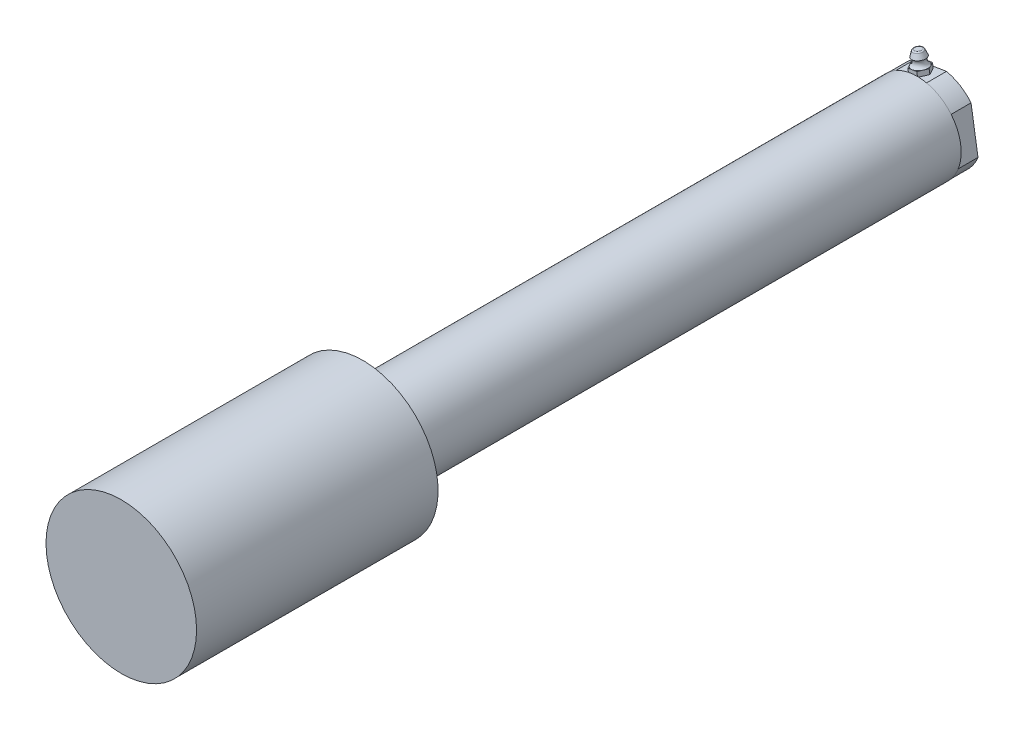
ISO-10303-21;
HEADER;
FILE_DESCRIPTION(('STEP AP214'),'2;1');
FILE_NAME('part.step','',(''),(''),'','','');
FILE_SCHEMA(('AUTOMOTIVE_DESIGN { 1 0 10303 214 1 1 1 1 }'));
ENDSEC;
DATA;
#1=APPLICATION_CONTEXT('core data for automotive mechanical design processes');
#2=APPLICATION_PROTOCOL_DEFINITION('international standard','automotive_design',2000,#1);
#3=PRODUCT_CONTEXT('',#1,'mechanical');
#4=PRODUCT('Part','Part','',(#3));
#5=PRODUCT_RELATED_PRODUCT_CATEGORY('part','',(#4));
#6=PRODUCT_DEFINITION_FORMATION('','',#4);
#7=PRODUCT_DEFINITION_CONTEXT('part definition',#1,'design');
#8=PRODUCT_DEFINITION('design','',#6,#7);
#9=PRODUCT_DEFINITION_SHAPE('','',#8);
#10=(LENGTH_UNIT() NAMED_UNIT(*) SI_UNIT(.MILLI.,.METRE.));
#11=(NAMED_UNIT(*) PLANE_ANGLE_UNIT() SI_UNIT($,.RADIAN.));
#12=(NAMED_UNIT(*) SI_UNIT($,.STERADIAN.) SOLID_ANGLE_UNIT());
#13=UNCERTAINTY_MEASURE_WITH_UNIT(LENGTH_MEASURE(1.E-05),#10,'distance_accuracy_value','');
#14=(GEOMETRIC_REPRESENTATION_CONTEXT(3) GLOBAL_UNCERTAINTY_ASSIGNED_CONTEXT((#13)) GLOBAL_UNIT_ASSIGNED_CONTEXT((#10,
#11,#12)) REPRESENTATION_CONTEXT('',''));
#15=CARTESIAN_POINT('',(0.,0.,0.));
#16=DIRECTION('',(0.,0.,1.));
#17=DIRECTION('',(1.,0.,0.));
#18=AXIS2_PLACEMENT_3D('',#15,#16,#17);
#19=CARTESIAN_POINT('',(-5.86397098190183,22.3762512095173,-411.89275));
#20=DIRECTION('',(-0.156434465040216,0.98768834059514,0.));
#21=DIRECTION('',(0.98768834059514,0.156434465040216,0.));
#22=AXIS2_PLACEMENT_3D('',#19,#20,#21);
#23=PLANE('',#22);
#24=CARTESIAN_POINT('',(-3.60082253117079,22.7346987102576,-407.924));
#25=DIRECTION('',(0.156434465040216,-0.98768834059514,0.));
#26=DIRECTION('',(0.,0.,-1.));
#27=AXIS2_PLACEMENT_3D('',#24,#25,#26);
#28=CIRCLE('',#27,3.96875);
#29=CARTESIAN_POINT('',(-3.60082253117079,22.7346987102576,-403.95525));
#30=VERTEX_POINT('',#29);
#31=CARTESIAN_POINT('',(-6.99554520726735,22.1970274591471,-405.939625));
#32=VERTEX_POINT('',#31);
#33=EDGE_CURVE('E147',#30,#32,#28,.T.);
#34=ORIENTED_EDGE('',*,*,#33,.T.);
#35=DIRECTION('',(0.49384417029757,0.0782172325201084,0.866025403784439));
#36=VECTOR('',#35,1.);
#37=CARTESIAN_POINT('',(-8.12711943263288,22.017803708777,-407.924));
#38=LINE('',#37,#36);
#39=CARTESIAN_POINT('',(-5.86397098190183,22.3762512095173,-403.95525));
#40=VERTEX_POINT('',#39);
#41=EDGE_CURVE('E161',#32,#40,#38,.T.);
#42=ORIENTED_EDGE('',*,*,#41,.T.);
#43=DIRECTION('',(0.98768834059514,0.156434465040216,0.));
#44=VECTOR('',#43,1.);
#45=CARTESIAN_POINT('',(-5.86397098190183,22.3762512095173,-403.95525));
#46=LINE('',#45,#44);
#47=EDGE_CURVE('E154',#40,#30,#46,.T.);
#48=ORIENTED_EDGE('',*,*,#47,.T.);
#49=EDGE_LOOP('',(#34,#42,#48));
#50=FACE_BOUND('',#49,.T.);
#51=ADVANCED_FACE('F17',(#50),#23,.T.);
#52=CARTESIAN_POINT('',(-0.206099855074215,23.2723699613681,-405.939625));
#53=VERTEX_POINT('',#52);
#54=EDGE_CURVE('E136',#53,#30,#28,.T.);
#55=ORIENTED_EDGE('',*,*,#54,.T.);
#56=CARTESIAN_POINT('',(-1.33767408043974,23.093146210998,-403.95525));
#57=VERTEX_POINT('',#56);
#58=EDGE_CURVE('E139',#30,#57,#46,.T.);
#59=ORIENTED_EDGE('',*,*,#58,.T.);
#60=DIRECTION('',(0.49384417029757,0.0782172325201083,-0.866025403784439));
#61=VECTOR('',#60,1.);
#62=CARTESIAN_POINT('',(-1.33767408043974,23.093146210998,-403.95525));
#63=LINE('',#62,#61);
#64=EDGE_CURVE('E142',#57,#53,#63,.T.);
#65=ORIENTED_EDGE('',*,*,#64,.T.);
#66=EDGE_LOOP('',(#55,#59,#65));
#67=FACE_BOUND('',#66,.T.);
#68=ADVANCED_FACE('F138',(#67),#23,.T.);
#69=CARTESIAN_POINT('',(-0.206099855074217,23.2723699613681,-409.908375));
#70=VERTEX_POINT('',#69);
#71=EDGE_CURVE('E146',#70,#53,#28,.T.);
#72=ORIENTED_EDGE('',*,*,#71,.T.);
#73=CARTESIAN_POINT('',(0.925474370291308,23.4515937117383,-407.924));
#74=VERTEX_POINT('',#73);
#75=EDGE_CURVE('E163',#53,#74,#63,.T.);
#76=ORIENTED_EDGE('',*,*,#75,.T.);
#77=DIRECTION('',(-0.49384417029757,-0.0782172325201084,-0.866025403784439));
#78=VECTOR('',#77,1.);
#79=CARTESIAN_POINT('',(0.925474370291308,23.4515937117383,-407.924));
#80=LINE('',#79,#78);
#81=EDGE_CURVE('E182',#74,#70,#80,.T.);
#82=ORIENTED_EDGE('',*,*,#81,.T.);
#83=EDGE_LOOP('',(#72,#76,#82));
#84=FACE_BOUND('',#83,.T.);
#85=ADVANCED_FACE('F306',(#84),#23,.T.);
#86=CARTESIAN_POINT('',(-3.60082253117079,22.7346987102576,-411.89275));
#87=VERTEX_POINT('',#86);
#88=EDGE_CURVE('E37',#87,#70,#28,.T.);
#89=ORIENTED_EDGE('',*,*,#88,.T.);
#90=CARTESIAN_POINT('',(-1.33767408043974,23.093146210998,-411.89275));
#91=VERTEX_POINT('',#90);
#92=EDGE_CURVE('E181',#70,#91,#80,.T.);
#93=ORIENTED_EDGE('',*,*,#92,.T.);
#94=DIRECTION('',(-0.98768834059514,-0.156434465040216,0.));
#95=VECTOR('',#94,1.);
#96=CARTESIAN_POINT('',(-1.33767408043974,23.093146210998,-411.89275));
#97=LINE('',#96,#95);
#98=EDGE_CURVE('E172',#91,#87,#97,.T.);
#99=ORIENTED_EDGE('',*,*,#98,.T.);
#100=EDGE_LOOP('',(#89,#93,#99));
#101=FACE_BOUND('',#100,.T.);
#102=ADVANCED_FACE('F324',(#101),#23,.T.);
#103=CARTESIAN_POINT('',(-6.99554520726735,22.1970274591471,-409.908375));
#104=VERTEX_POINT('',#103);
#105=EDGE_CURVE('E167',#104,#87,#28,.T.);
#106=ORIENTED_EDGE('',*,*,#105,.T.);
#107=CARTESIAN_POINT('',(-5.86397098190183,22.3762512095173,-411.89275));
#108=VERTEX_POINT('',#107);
#109=EDGE_CURVE('E175',#87,#108,#97,.T.);
#110=ORIENTED_EDGE('',*,*,#109,.T.);
#111=DIRECTION('',(-0.493844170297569,-0.0782172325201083,0.866025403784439));
#112=VECTOR('',#111,1.);
#113=CARTESIAN_POINT('',(-5.86397098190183,22.3762512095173,-411.89275));
#114=LINE('',#113,#112);
#115=EDGE_CURVE('E176',#108,#104,#114,.T.);
#116=ORIENTED_EDGE('',*,*,#115,.T.);
#117=EDGE_LOOP('',(#106,#110,#116));
#118=FACE_BOUND('',#117,.T.);
#119=ADVANCED_FACE('F312',(#118),#23,.T.);
#120=CARTESIAN_POINT('',(-1.33767408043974,23.093146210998,-411.89275));
#121=DIRECTION('',(0.,0.,1.));
#122=DIRECTION('',(0.156434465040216,-0.98768834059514,0.));
#123=AXIS2_PLACEMENT_3D('',#120,#121,#122);
#124=PLANE('',#123);
#125=DIRECTION('',(-0.98768834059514,-0.156434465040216,0.));
#126=VECTOR('',#125,1.);
#127=CARTESIAN_POINT('',(-0.965164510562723,20.7412133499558,-411.89275));
#128=LINE('',#127,#126);
#129=CARTESIAN_POINT('',(-0.965164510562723,20.7412133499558,-411.89275));
#130=VERTEX_POINT('',#129);
#131=CARTESIAN_POINT('',(-5.49146141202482,20.0243183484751,-411.89275));
#132=VERTEX_POINT('',#131);
#133=EDGE_CURVE('E170',#130,#132,#128,.T.);
#134=ORIENTED_EDGE('',*,*,#133,.T.);
#135=DIRECTION('',(0.156434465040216,-0.98768834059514,0.));
#136=VECTOR('',#135,1.);
#137=CARTESIAN_POINT('',(-5.86397098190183,22.3762512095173,-411.89275));
#138=LINE('',#137,#136);
#139=EDGE_CURVE('E209',#108,#132,#138,.T.);
#140=ORIENTED_EDGE('',*,*,#139,.F.);
#141=ORIENTED_EDGE('',*,*,#109,.F.);
#142=ORIENTED_EDGE('',*,*,#98,.F.);
#143=DIRECTION('',(0.156434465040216,-0.98768834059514,0.));
#144=VECTOR('',#143,1.);
#145=CARTESIAN_POINT('',(-1.33767408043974,23.093146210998,-411.89275));
#146=LINE('',#145,#144);
#147=EDGE_CURVE('E185',#91,#130,#146,.T.);
#148=ORIENTED_EDGE('',*,*,#147,.T.);
#149=EDGE_LOOP('',(#134,#140,#141,#142,#148));
#150=FACE_BOUND('',#149,.T.);
#151=ADVANCED_FACE('F323',(#150),#124,.F.);
#152=CARTESIAN_POINT('',(-5.86397098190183,22.3762512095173,-411.89275));
#153=DIRECTION('',(0.855363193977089,0.135476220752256,0.5));
#154=DIRECTION('',(0.49384417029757,0.0782172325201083,-0.866025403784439));
#155=AXIS2_PLACEMENT_3D('',#152,#153,#154);
#156=PLANE('',#155);
#157=DIRECTION('',(-0.493844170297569,-0.0782172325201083,0.866025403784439));
#158=VECTOR('',#157,1.);
#159=CARTESIAN_POINT('',(-5.49146141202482,20.0243183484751,-411.89275));
#160=LINE('',#159,#158);
#161=CARTESIAN_POINT('',(-7.75460986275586,19.6658708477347,-407.924));
#162=VERTEX_POINT('',#161);
#163=EDGE_CURVE('E188',#132,#162,#160,.T.);
#164=ORIENTED_EDGE('',*,*,#163,.T.);
#165=DIRECTION('',(0.156434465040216,-0.98768834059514,0.));
#166=VECTOR('',#165,1.);
#167=CARTESIAN_POINT('',(-8.12711943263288,22.017803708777,-407.924));
#168=LINE('',#167,#166);
#169=CARTESIAN_POINT('',(-8.12711943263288,22.017803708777,-407.924));
#170=VERTEX_POINT('',#169);
#171=EDGE_CURVE('E206',#170,#162,#168,.T.);
#172=ORIENTED_EDGE('',*,*,#171,.F.);
#173=EDGE_CURVE('E174',#104,#170,#114,.T.);
#174=ORIENTED_EDGE('',*,*,#173,.F.);
#175=ORIENTED_EDGE('',*,*,#115,.F.);
#176=ORIENTED_EDGE('',*,*,#139,.T.);
#177=EDGE_LOOP('',(#164,#172,#174,#175,#176));
#178=FACE_BOUND('',#177,.T.);
#179=ADVANCED_FACE('F331',(#178),#156,.F.);
#180=CARTESIAN_POINT('',(-8.12711943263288,22.017803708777,-407.924));
#181=DIRECTION('',(0.855363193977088,0.135476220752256,-0.5));
#182=DIRECTION('',(-0.49384417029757,-0.0782172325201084,-0.866025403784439));
#183=AXIS2_PLACEMENT_3D('',#180,#181,#182);
#184=PLANE('',#183);
#185=DIRECTION('',(0.49384417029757,0.0782172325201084,0.866025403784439));
#186=VECTOR('',#185,1.);
#187=CARTESIAN_POINT('',(-7.75460986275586,19.6658708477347,-407.924));
#188=LINE('',#187,#186);
#189=CARTESIAN_POINT('',(-5.49146141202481,20.0243183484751,-403.95525));
#190=VERTEX_POINT('',#189);
#191=EDGE_CURVE('E190',#162,#190,#188,.T.);
#192=ORIENTED_EDGE('',*,*,#191,.T.);
#193=DIRECTION('',(0.156434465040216,-0.98768834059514,0.));
#194=VECTOR('',#193,1.);
#195=CARTESIAN_POINT('',(-5.86397098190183,22.3762512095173,-403.95525));
#196=LINE('',#195,#194);
#197=EDGE_CURVE('E204',#40,#190,#196,.T.);
#198=ORIENTED_EDGE('',*,*,#197,.F.);
#199=ORIENTED_EDGE('',*,*,#41,.F.);
#200=EDGE_CURVE('E92',#170,#32,#38,.T.);
#201=ORIENTED_EDGE('',*,*,#200,.F.);
#202=ORIENTED_EDGE('',*,*,#171,.T.);
#203=EDGE_LOOP('',(#192,#198,#199,#201,#202));
#204=FACE_BOUND('',#203,.T.);
#205=ADVANCED_FACE('F353',(#204),#184,.F.);
#206=CARTESIAN_POINT('',(-5.86397098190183,22.3762512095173,-403.95525));
#207=DIRECTION('',(0.,0.,-1.));
#208=DIRECTION('',(-0.98768834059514,-0.156434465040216,0.));
#209=AXIS2_PLACEMENT_3D('',#206,#207,#208);
#210=PLANE('',#209);
#211=DIRECTION('',(0.98768834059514,0.156434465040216,0.));
#212=VECTOR('',#211,1.);
#213=CARTESIAN_POINT('',(-5.49146141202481,20.0243183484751,-403.95525));
#214=LINE('',#213,#212);
#215=CARTESIAN_POINT('',(-0.965164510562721,20.7412133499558,-403.95525));
#216=VERTEX_POINT('',#215);
#217=EDGE_CURVE('E192',#190,#216,#214,.T.);
#218=ORIENTED_EDGE('',*,*,#217,.T.);
#219=DIRECTION('',(0.156434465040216,-0.98768834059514,0.));
#220=VECTOR('',#219,1.);
#221=CARTESIAN_POINT('',(-1.33767408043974,23.093146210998,-403.95525));
#222=LINE('',#221,#220);
#223=EDGE_CURVE('E156',#57,#216,#222,.T.);
#224=ORIENTED_EDGE('',*,*,#223,.F.);
#225=ORIENTED_EDGE('',*,*,#58,.F.);
#226=ORIENTED_EDGE('',*,*,#47,.F.);
#227=ORIENTED_EDGE('',*,*,#197,.T.);
#228=EDGE_LOOP('',(#218,#224,#225,#226,#227));
#229=FACE_BOUND('',#228,.T.);
#230=ADVANCED_FACE('F152',(#229),#210,.F.);
#231=CARTESIAN_POINT('',(-1.33767408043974,23.093146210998,-403.95525));
#232=DIRECTION('',(-0.855363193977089,-0.135476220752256,-0.5));
#233=DIRECTION('',(-0.49384417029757,-0.0782172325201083,0.866025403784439));
#234=AXIS2_PLACEMENT_3D('',#231,#232,#233);
#235=PLANE('',#234);
#236=DIRECTION('',(0.49384417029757,0.0782172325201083,-0.866025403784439));
#237=VECTOR('',#236,1.);
#238=CARTESIAN_POINT('',(-0.965164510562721,20.7412133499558,-403.95525));
#239=LINE('',#238,#237);
#240=CARTESIAN_POINT('',(1.29798394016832,21.0996608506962,-407.924));
#241=VERTEX_POINT('',#240);
#242=EDGE_CURVE('E194',#216,#241,#239,.T.);
#243=ORIENTED_EDGE('',*,*,#242,.T.);
#244=DIRECTION('',(0.156434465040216,-0.98768834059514,0.));
#245=VECTOR('',#244,1.);
#246=CARTESIAN_POINT('',(0.925474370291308,23.4515937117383,-407.924));
#247=LINE('',#246,#245);
#248=EDGE_CURVE('E200',#74,#241,#247,.T.);
#249=ORIENTED_EDGE('',*,*,#248,.F.);
#250=ORIENTED_EDGE('',*,*,#75,.F.);
#251=ORIENTED_EDGE('',*,*,#64,.F.);
#252=ORIENTED_EDGE('',*,*,#223,.T.);
#253=EDGE_LOOP('',(#243,#249,#250,#251,#252));
#254=FACE_BOUND('',#253,.T.);
#255=ADVANCED_FACE('F320',(#254),#235,.F.);
#256=CARTESIAN_POINT('',(0.925474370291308,23.4515937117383,-407.924));
#257=DIRECTION('',(-0.855363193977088,-0.135476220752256,0.5));
#258=DIRECTION('',(0.49384417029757,0.0782172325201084,0.866025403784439));
#259=AXIS2_PLACEMENT_3D('',#256,#257,#258);
#260=PLANE('',#259);
#261=DIRECTION('',(-0.49384417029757,-0.0782172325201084,-0.866025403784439));
#262=VECTOR('',#261,1.);
#263=CARTESIAN_POINT('',(1.29798394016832,21.0996608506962,-407.924));
#264=LINE('',#263,#262);
#265=EDGE_CURVE('E196',#241,#130,#264,.T.);
#266=ORIENTED_EDGE('',*,*,#265,.T.);
#267=ORIENTED_EDGE('',*,*,#147,.F.);
#268=ORIENTED_EDGE('',*,*,#92,.F.);
#269=ORIENTED_EDGE('',*,*,#81,.F.);
#270=ORIENTED_EDGE('',*,*,#248,.T.);
#271=EDGE_LOOP('',(#266,#267,#268,#269,#270));
#272=FACE_BOUND('',#271,.T.);
#273=ADVANCED_FACE('F311',(#272),#260,.F.);
#274=EDGE_CURVE('E166',#32,#104,#28,.T.);
#275=ORIENTED_EDGE('',*,*,#274,.T.);
#276=ORIENTED_EDGE('',*,*,#173,.T.);
#277=ORIENTED_EDGE('',*,*,#200,.T.);
#278=EDGE_LOOP('',(#275,#276,#277));
#279=FACE_BOUND('',#278,.T.);
#280=ADVANCED_FACE('F301',(#279),#23,.T.);
#281=CARTESIAN_POINT('',(-4.17945406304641,26.3880344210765,-407.924));
#282=DIRECTION('',(0.156434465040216,-0.98768834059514,0.));
#283=DIRECTION('',(0.,0.,-1.));
#284=AXIS2_PLACEMENT_3D('',#281,#282,#283);
#285=CONICAL_SURFACE('',#284,3.3655,0.340381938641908);
#286=CARTESIAN_POINT('',(-4.57685885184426,28.8971495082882,-407.924));
#287=DIRECTION('',(-0.156434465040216,0.98768834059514,0.));
#288=DIRECTION('',(0.,0.,1.));
#289=AXIS2_PLACEMENT_3D('',#286,#287,#288);
#290=CIRCLE('',#289,2.46577800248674);
#291=CARTESIAN_POINT('',(-4.57685885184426,28.8971495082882,-405.458221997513));
#292=VERTEX_POINT('',#291);
#293=EDGE_CURVE('E212',#292,#292,#290,.F.);
#294=ORIENTED_EDGE('',*,*,#293,.T.);
#295=EDGE_LOOP('',(#294));
#296=FACE_BOUND('',#295,.T.);
#297=CARTESIAN_POINT('',(-4.17945406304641,26.3880344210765,-407.924));
#298=DIRECTION('',(0.156434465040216,-0.98768834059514,0.));
#299=DIRECTION('',(0.,0.,-1.));
#300=AXIS2_PLACEMENT_3D('',#297,#298,#299);
#301=CIRCLE('',#300,3.3655);
#302=CARTESIAN_POINT('',(-4.17945406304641,26.3880344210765,-411.2895));
#303=VERTEX_POINT('',#302);
#304=EDGE_CURVE('E171',#303,#303,#301,.T.);
#305=ORIENTED_EDGE('',*,*,#304,.F.);
#306=EDGE_LOOP('',(#305));
#307=FACE_BOUND('',#306,.T.);
#308=ADVANCED_FACE('F310',(#296,#307),#285,.T.);
#309=CARTESIAN_POINT('',(-4.656266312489,29.3985084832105,-407.924));
#310=DIRECTION('',(-0.156434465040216,0.98768834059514,0.));
#311=DIRECTION('',(0.,0.,1.));
#312=AXIS2_PLACEMENT_3D('',#309,#310,#311);
#313=PLANE('',#312);
#314=CARTESIAN_POINT('',(-4.656266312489,29.3985084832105,-407.924));
#315=DIRECTION('',(-0.156434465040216,0.98768834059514,0.));
#316=DIRECTION('',(0.,0.,1.));
#317=AXIS2_PLACEMENT_3D('',#314,#315,#316);
#318=CIRCLE('',#317,1.7474960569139);
#319=CARTESIAN_POINT('',(-4.656266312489,29.3985084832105,-406.176503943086));
#320=VERTEX_POINT('',#319);
#321=EDGE_CURVE('E28',#320,#320,#318,.T.);
#322=ORIENTED_EDGE('',*,*,#321,.T.);
#323=EDGE_LOOP('',(#322));
#324=FACE_BOUND('',#323,.T.);
#325=ADVANCED_FACE('F318',(#324),#313,.T.);
#326=CARTESIAN_POINT('',(-3.92942332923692,24.8094024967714,-407.924));
#327=DIRECTION('',(0.156434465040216,-0.98768834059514,0.));
#328=DIRECTION('',(0.,0.,-1.));
#329=AXIS2_PLACEMENT_3D('',#326,#327,#328);
#330=TOROIDAL_SURFACE('',#329,5.20693450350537,2.43833450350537);
#331=ORIENTED_EDGE('',*,*,#304,.T.);
#332=EDGE_LOOP('',(#331));
#333=FACE_BOUND('',#332,.T.);
#334=ORIENTED_EDGE('',*,*,#88,.F.);
#335=ORIENTED_EDGE('',*,*,#105,.F.);
#336=ORIENTED_EDGE('',*,*,#274,.F.);
#337=ORIENTED_EDGE('',*,*,#33,.F.);
#338=ORIENTED_EDGE('',*,*,#54,.F.);
#339=ORIENTED_EDGE('',*,*,#71,.F.);
#340=EDGE_LOOP('',(#334,#335,#336,#337,#338,#339));
#341=FACE_BOUND('',#340,.T.);
#342=ADVANCED_FACE('F164',(#333,#341),#330,.F.);
#343=CARTESIAN_POINT('',(-4.53706325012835,28.645889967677,-407.924));
#344=DIRECTION('',(-0.156434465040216,0.98768834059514,0.));
#345=DIRECTION('',(0.,0.,1.));
#346=AXIS2_PLACEMENT_3D('',#343,#344,#345);
#347=TOROIDAL_SURFACE('',#346,1.7474960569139,0.762);
#348=ORIENTED_EDGE('',*,*,#321,.F.);
#349=EDGE_LOOP('',(#348));
#350=FACE_BOUND('',#349,.T.);
#351=ORIENTED_EDGE('',*,*,#293,.F.);
#352=EDGE_LOOP('',(#351));
#353=FACE_BOUND('',#352,.T.);
#354=ADVANCED_FACE('F411',(#350,#353),#347,.T.);
#355=CARTESIAN_POINT('',(0.,0.,0.));
#356=DIRECTION('',(0.,0.,1.));
#357=DIRECTION('',(1.,0.,0.));
#358=AXIS2_PLACEMENT_3D('',#355,#356,#357);
#359=PLANE('',#358);
#360=CARTESIAN_POINT('',(0.,0.,0.));
#361=DIRECTION('',(0.,0.,1.));
#362=DIRECTION('',(1.,0.,0.));
#363=AXIS2_PLACEMENT_3D('',#360,#361,#362);
#364=CIRCLE('',#363,38.1);
#365=CARTESIAN_POINT('',(38.1,0.,0.));
#366=VERTEX_POINT('',#365);
#367=EDGE_CURVE('E265',#366,#366,#364,.T.);
#368=ORIENTED_EDGE('',*,*,#367,.T.);
#369=EDGE_LOOP('',(#368));
#370=FACE_BOUND('',#369,.T.);
#371=ADVANCED_FACE('F294',(#370),#359,.T.);
#372=CARTESIAN_POINT('',(0.,0.,0.));
#373=DIRECTION('',(0.,0.,-1.));
#374=DIRECTION('',(-1.,0.,0.));
#375=AXIS2_PLACEMENT_3D('',#372,#373,#374);
#376=CYLINDRICAL_SURFACE('',#375,38.1);
#377=ORIENTED_EDGE('',*,*,#367,.F.);
#378=EDGE_LOOP('',(#377));
#379=FACE_BOUND('',#378,.T.);
#380=CARTESIAN_POINT('',(0.,0.,-122.21972));
#381=DIRECTION('',(0.,0.,-1.));
#382=DIRECTION('',(-1.,0.,0.));
#383=AXIS2_PLACEMENT_3D('',#380,#381,#382);
#384=CIRCLE('',#383,38.1);
#385=CARTESIAN_POINT('',(-38.1,0.,-122.21972));
#386=VERTEX_POINT('',#385);
#387=EDGE_CURVE('E262',#386,#386,#384,.T.);
#388=ORIENTED_EDGE('',*,*,#387,.F.);
#389=EDGE_LOOP('',(#388));
#390=FACE_BOUND('',#389,.T.);
#391=ADVANCED_FACE('F409',(#379,#390),#376,.T.);
#392=CARTESIAN_POINT('',(0.,0.,-374.904));
#393=DIRECTION('',(0.,0.,-1.));
#394=DIRECTION('',(-0.156434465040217,0.98768834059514,0.));
#395=AXIS2_PLACEMENT_3D('',#392,#393,#394);
#396=PLANE('',#395);
#397=CARTESIAN_POINT('',(0.,0.,-374.904));
#398=DIRECTION('',(0.,0.,-1.));
#399=DIRECTION('',(-0.156434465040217,0.98768834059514,0.));
#400=AXIS2_PLACEMENT_3D('',#397,#398,#399);
#401=CIRCLE('',#400,8.73125);
#402=CARTESIAN_POINT('',(-1.3658684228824,8.62375382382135,-374.904));
#403=VERTEX_POINT('',#402);
#404=EDGE_CURVE('E217',#403,#403,#401,.T.);
#405=ORIENTED_EDGE('',*,*,#404,.T.);
#406=EDGE_LOOP('',(#405));
#407=FACE_BOUND('',#406,.T.);
#408=ADVANCED_FACE('F289',(#407),#396,.T.);
#409=CARTESIAN_POINT('',(0.,0.,-122.21972));
#410=DIRECTION('',(0.,0.,-1.));
#411=DIRECTION('',(-1.,0.,0.));
#412=AXIS2_PLACEMENT_3D('',#409,#410,#411);
#413=PLANE('',#412);
#414=CARTESIAN_POINT('',(0.,0.,-122.21972));
#415=DIRECTION('',(0.,0.,-1.));
#416=DIRECTION('',(-1.,0.,0.));
#417=AXIS2_PLACEMENT_3D('',#414,#415,#416);
#418=CIRCLE('',#417,22.225);
#419=CARTESIAN_POINT('',(-22.225,0.,-122.21972));
#420=VERTEX_POINT('',#419);
#421=EDGE_CURVE('E21',#420,#420,#418,.T.);
#422=ORIENTED_EDGE('',*,*,#421,.F.);
#423=EDGE_LOOP('',(#422));
#424=FACE_BOUND('',#423,.T.);
#425=ORIENTED_EDGE('',*,*,#387,.T.);
#426=EDGE_LOOP('',(#425));
#427=FACE_BOUND('',#426,.T.);
#428=ADVANCED_FACE('F276',(#424,#427),#413,.T.);
#429=CARTESIAN_POINT('',(0.,0.,-413.004));
#430=DIRECTION('',(0.,0.,-1.));
#431=DIRECTION('',(-0.156434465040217,0.98768834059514,0.));
#432=AXIS2_PLACEMENT_3D('',#429,#430,#431);
#433=CYLINDRICAL_SURFACE('',#432,8.73125);
#434=ORIENTED_EDGE('',*,*,#404,.F.);
#435=EDGE_LOOP('',(#434));
#436=FACE_BOUND('',#435,.T.);
#437=CARTESIAN_POINT('',(0.,0.,-413.004));
#438=DIRECTION('',(0.,0.,-1.));
#439=DIRECTION('',(-0.156434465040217,0.98768834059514,0.));
#440=AXIS2_PLACEMENT_3D('',#437,#438,#439);
#441=CIRCLE('',#440,8.73125);
#442=CARTESIAN_POINT('',(-1.3658684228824,8.62375382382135,-413.004));
#443=VERTEX_POINT('',#442);
#444=EDGE_CURVE('E250',#443,#443,#441,.T.);
#445=ORIENTED_EDGE('',*,*,#444,.T.);
#446=EDGE_LOOP('',(#445));
#447=FACE_BOUND('',#446,.T.);
#448=ADVANCED_FACE('F274',(#436,#447),#433,.F.);
#449=CARTESIAN_POINT('',(0.,0.,-402.844));
#450=DIRECTION('',(0.,0.,1.));
#451=DIRECTION('',(1.,0.,0.));
#452=AXIS2_PLACEMENT_3D('',#449,#450,#451);
#453=CYLINDRICAL_SURFACE('',#452,22.225);
#454=ORIENTED_EDGE('',*,*,#421,.T.);
#455=EDGE_LOOP('',(#454));
#456=FACE_BOUND('',#455,.T.);
#457=CARTESIAN_POINT('',(0.,0.,-402.844));
#458=DIRECTION('',(0.,0.,-1.));
#459=DIRECTION('',(-1.,0.,0.));
#460=AXIS2_PLACEMENT_3D('',#457,#458,#459);
#461=CIRCLE('',#460,22.225);
#462=CARTESIAN_POINT('',(-22.225,0.,-402.844));
#463=VERTEX_POINT('',#462);
#464=EDGE_CURVE('E221',#463,#463,#461,.T.);
#465=ORIENTED_EDGE('',*,*,#464,.F.);
#466=EDGE_LOOP('',(#465));
#467=FACE_BOUND('',#466,.T.);
#468=ADVANCED_FACE('F19',(#456,#467),#453,.T.);
#469=CARTESIAN_POINT('',(20.571299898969,-8.10584202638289,-380.188093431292));
#470=DIRECTION('',(-0.98768834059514,-0.156434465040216,0.));
#471=DIRECTION('',(-0.156434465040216,0.98768834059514,0.));
#472=AXIS2_PLACEMENT_3D('',#469,#470,#471);
#473=PLANE('',#472);
#474=DIRECTION('',(0.156434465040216,-0.98768834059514,0.));
#475=VECTOR('',#474,1.);
#476=CARTESIAN_POINT('',(20.571299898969,-8.10584202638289,-402.844));
#477=LINE('',#476,#475);
#478=CARTESIAN_POINT('',(17.0596258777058,14.0659951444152,-402.844));
#479=VERTEX_POINT('',#478);
#480=CARTESIAN_POINT('',(20.571299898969,-8.10584202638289,-402.844));
#481=VERTEX_POINT('',#480);
#482=EDGE_CURVE('E247',#479,#481,#477,.T.);
#483=ORIENTED_EDGE('',*,*,#482,.T.);
#484=DIRECTION('',(0.,0.,-1.));
#485=VECTOR('',#484,1.);
#486=CARTESIAN_POINT('',(20.571299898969,-8.10584202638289,-380.188093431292));
#487=LINE('',#486,#485);
#488=CARTESIAN_POINT('',(20.571299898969,-8.10584202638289,-413.004));
#489=VERTEX_POINT('',#488);
#490=EDGE_CURVE('E243',#481,#489,#487,.T.);
#491=ORIENTED_EDGE('',*,*,#490,.T.);
#492=DIRECTION('',(-0.156434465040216,0.98768834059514,0.));
#493=VECTOR('',#492,1.);
#494=CARTESIAN_POINT('',(20.571299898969,-8.10584202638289,-413.004));
#495=LINE('',#494,#493);
#496=CARTESIAN_POINT('',(17.0596258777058,14.0659951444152,-413.004));
#497=VERTEX_POINT('',#496);
#498=EDGE_CURVE('E240',#489,#497,#495,.T.);
#499=ORIENTED_EDGE('',*,*,#498,.T.);
#500=DIRECTION('',(0.,0.,-1.));
#501=VECTOR('',#500,1.);
#502=CARTESIAN_POINT('',(17.0596258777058,14.0659951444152,-380.188093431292));
#503=LINE('',#502,#501);
#504=EDGE_CURVE('E244',#479,#497,#503,.T.);
#505=ORIENTED_EDGE('',*,*,#504,.F.);
#506=EDGE_LOOP('',(#483,#491,#499,#505));
#507=FACE_BOUND('',#506,.T.);
#508=ADVANCED_FACE('F273',(#507),#473,.F.);
#509=CARTESIAN_POINT('',(0.,0.,-402.844));
#510=DIRECTION('',(0.,0.,-1.));
#511=DIRECTION('',(-0.156434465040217,0.98768834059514,0.));
#512=AXIS2_PLACEMENT_3D('',#509,#510,#511);
#513=CYLINDRICAL_SURFACE('',#512,22.1107);
#514=DIRECTION('',(0.,0.,-1.));
#515=VECTOR('',#514,1.);
#516=CARTESIAN_POINT('',(-17.0596258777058,-14.0659951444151,-380.188093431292));
#517=LINE('',#516,#515);
#518=CARTESIAN_POINT('',(-17.0596258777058,-14.0659951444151,-402.844));
#519=VERTEX_POINT('',#518);
#520=CARTESIAN_POINT('',(-17.0596258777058,-14.0659951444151,-413.004));
#521=VERTEX_POINT('',#520);
#522=EDGE_CURVE('E234',#519,#521,#517,.T.);
#523=ORIENTED_EDGE('',*,*,#522,.T.);
#524=CARTESIAN_POINT('',(0.,0.,-413.004));
#525=DIRECTION('',(0.,0.,-1.));
#526=DIRECTION('',(-0.156434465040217,0.98768834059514,0.));
#527=AXIS2_PLACEMENT_3D('',#524,#525,#526);
#528=CIRCLE('',#527,22.1107);
#529=EDGE_CURVE('E258',#489,#521,#528,.T.);
#530=ORIENTED_EDGE('',*,*,#529,.F.);
#531=ORIENTED_EDGE('',*,*,#490,.F.);
#532=CARTESIAN_POINT('',(0.,0.,-402.844));
#533=DIRECTION('',(0.,0.,-1.));
#534=DIRECTION('',(-0.156434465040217,0.98768834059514,0.));
#535=AXIS2_PLACEMENT_3D('',#532,#533,#534);
#536=CIRCLE('',#535,22.1107);
#537=EDGE_CURVE('E254',#481,#519,#536,.T.);
#538=ORIENTED_EDGE('',*,*,#537,.T.);
#539=EDGE_LOOP('',(#523,#530,#531,#538));
#540=FACE_BOUND('',#539,.T.);
#541=ADVANCED_FACE('F283',(#540),#513,.T.);
#542=CARTESIAN_POINT('',(-17.0596258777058,-14.0659951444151,-380.188093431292));
#543=DIRECTION('',(0.98768834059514,0.156434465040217,0.));
#544=DIRECTION('',(0.,0.,-1.));
#545=AXIS2_PLACEMENT_3D('',#542,#543,#544);
#546=PLANE('',#545);
#547=DIRECTION('',(-0.156434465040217,0.98768834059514,0.));
#548=VECTOR('',#547,1.);
#549=CARTESIAN_POINT('',(-17.0596258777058,-14.0659951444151,-402.844));
#550=LINE('',#549,#548);
#551=CARTESIAN_POINT('',(-20.5712998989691,8.10584202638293,-402.844));
#552=VERTEX_POINT('',#551);
#553=EDGE_CURVE('E237',#519,#552,#550,.T.);
#554=ORIENTED_EDGE('',*,*,#553,.T.);
#555=DIRECTION('',(0.,0.,-1.));
#556=VECTOR('',#555,1.);
#557=CARTESIAN_POINT('',(-20.5712998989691,8.10584202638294,-380.188093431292));
#558=LINE('',#557,#556);
#559=CARTESIAN_POINT('',(-20.5712998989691,8.10584202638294,-413.004));
#560=VERTEX_POINT('',#559);
#561=EDGE_CURVE('E77',#552,#560,#558,.T.);
#562=ORIENTED_EDGE('',*,*,#561,.T.);
#563=DIRECTION('',(0.156434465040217,-0.98768834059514,0.));
#564=VECTOR('',#563,1.);
#565=CARTESIAN_POINT('',(-17.0596258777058,-14.0659951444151,-413.004));
#566=LINE('',#565,#564);
#567=EDGE_CURVE('E232',#560,#521,#566,.T.);
#568=ORIENTED_EDGE('',*,*,#567,.T.);
#569=ORIENTED_EDGE('',*,*,#522,.F.);
#570=EDGE_LOOP('',(#554,#562,#568,#569));
#571=FACE_BOUND('',#570,.T.);
#572=ADVANCED_FACE('F286',(#571),#546,.F.);
#573=DIRECTION('',(0.,0.,-1.));
#574=VECTOR('',#573,1.);
#575=CARTESIAN_POINT('',(-11.0680891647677,19.1410672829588,-386.900729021));
#576=LINE('',#575,#574);
#577=CARTESIAN_POINT('',(-11.0680891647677,19.1410672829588,-402.844));
#578=VERTEX_POINT('',#577);
#579=CARTESIAN_POINT('',(-11.0680891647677,19.1410672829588,-413.004));
#580=VERTEX_POINT('',#579);
#581=EDGE_CURVE('E226',#578,#580,#576,.T.);
#582=ORIENTED_EDGE('',*,*,#581,.T.);
#583=EDGE_CURVE('E261',#560,#580,#528,.T.);
#584=ORIENTED_EDGE('',*,*,#583,.F.);
#585=ORIENTED_EDGE('',*,*,#561,.F.);
#586=EDGE_CURVE('E256',#552,#578,#536,.T.);
#587=ORIENTED_EDGE('',*,*,#586,.T.);
#588=EDGE_LOOP('',(#582,#584,#585,#587));
#589=FACE_BOUND('',#588,.T.);
#590=ADVANCED_FACE('F374',(#589),#513,.T.);
#591=CARTESIAN_POINT('',(0.,0.,-413.004));
#592=DIRECTION('',(0.,0.,-1.));
#593=DIRECTION('',(-0.156434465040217,0.98768834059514,0.));
#594=AXIS2_PLACEMENT_3D('',#591,#592,#593);
#595=PLANE('',#594);
#596=DIRECTION('',(-0.98768834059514,-0.156434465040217,0.));
#597=VECTOR('',#596,1.);
#598=CARTESIAN_POINT('',(4.61146324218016,21.6244644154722,-413.004));
#599=LINE('',#598,#597);
#600=CARTESIAN_POINT('',(4.61146324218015,21.6244644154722,-413.004));
#601=VERTEX_POINT('',#600);
#602=EDGE_CURVE('E224',#601,#580,#599,.T.);
#603=ORIENTED_EDGE('',*,*,#602,.F.);
#604=EDGE_CURVE('E253',#601,#497,#528,.T.);
#605=ORIENTED_EDGE('',*,*,#604,.T.);
#606=ORIENTED_EDGE('',*,*,#498,.F.);
#607=ORIENTED_EDGE('',*,*,#529,.T.);
#608=ORIENTED_EDGE('',*,*,#567,.F.);
#609=ORIENTED_EDGE('',*,*,#583,.T.);
#610=EDGE_LOOP('',(#603,#605,#606,#607,#608,#609));
#611=FACE_BOUND('',#610,.T.);
#612=ORIENTED_EDGE('',*,*,#444,.F.);
#613=EDGE_LOOP('',(#612));
#614=FACE_BOUND('',#613,.T.);
#615=ADVANCED_FACE('F371',(#611,#614),#595,.T.);
#616=DIRECTION('',(0.,0.,-1.));
#617=VECTOR('',#616,1.);
#618=CARTESIAN_POINT('',(4.61146324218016,21.6244644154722,-386.900729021));
#619=LINE('',#618,#617);
#620=CARTESIAN_POINT('',(4.61146324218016,21.6244644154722,-402.844));
#621=VERTEX_POINT('',#620);
#622=EDGE_CURVE('E83',#621,#601,#619,.T.);
#623=ORIENTED_EDGE('',*,*,#622,.F.);
#624=EDGE_CURVE('E257',#621,#479,#536,.T.);
#625=ORIENTED_EDGE('',*,*,#624,.T.);
#626=ORIENTED_EDGE('',*,*,#504,.T.);
#627=ORIENTED_EDGE('',*,*,#604,.F.);
#628=EDGE_LOOP('',(#623,#625,#626,#627));
#629=FACE_BOUND('',#628,.T.);
#630=ADVANCED_FACE('F297',(#629),#513,.T.);
#631=CARTESIAN_POINT('',(0.,0.,-402.844));
#632=DIRECTION('',(0.,0.,-1.));
#633=DIRECTION('',(-1.,0.,0.));
#634=AXIS2_PLACEMENT_3D('',#631,#632,#633);
#635=PLANE('',#634);
#636=ORIENTED_EDGE('',*,*,#553,.F.);
#637=ORIENTED_EDGE('',*,*,#537,.F.);
#638=ORIENTED_EDGE('',*,*,#482,.F.);
#639=ORIENTED_EDGE('',*,*,#624,.F.);
#640=DIRECTION('',(0.98768834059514,0.156434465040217,0.));
#641=VECTOR('',#640,1.);
#642=CARTESIAN_POINT('',(4.61146324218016,21.6244644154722,-402.844));
#643=LINE('',#642,#641);
#644=EDGE_CURVE('E229',#578,#621,#643,.T.);
#645=ORIENTED_EDGE('',*,*,#644,.F.);
#646=ORIENTED_EDGE('',*,*,#586,.F.);
#647=EDGE_LOOP('',(#636,#637,#638,#639,#645,#646));
#648=FACE_BOUND('',#647,.T.);
#649=ORIENTED_EDGE('',*,*,#464,.T.);
#650=EDGE_LOOP('',(#649));
#651=FACE_BOUND('',#650,.T.);
#652=ADVANCED_FACE('F270',(#648,#651),#635,.T.);
#653=CARTESIAN_POINT('',(4.61146324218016,21.6244644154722,-386.900729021));
#654=DIRECTION('',(0.156434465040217,-0.98768834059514,0.));
#655=DIRECTION('',(0.,0.,-1.));
#656=AXIS2_PLACEMENT_3D('',#653,#654,#655);
#657=PLANE('',#656);
#658=ORIENTED_EDGE('',*,*,#133,.F.);
#659=ORIENTED_EDGE('',*,*,#265,.F.);
#660=ORIENTED_EDGE('',*,*,#242,.F.);
#661=ORIENTED_EDGE('',*,*,#217,.F.);
#662=ORIENTED_EDGE('',*,*,#191,.F.);
#663=ORIENTED_EDGE('',*,*,#163,.F.);
#664=EDGE_LOOP('',(#658,#659,#660,#661,#662,#663));
#665=FACE_BOUND('',#664,.T.);
#666=ORIENTED_EDGE('',*,*,#644,.T.);
#667=ORIENTED_EDGE('',*,*,#622,.T.);
#668=ORIENTED_EDGE('',*,*,#602,.T.);
#669=ORIENTED_EDGE('',*,*,#581,.F.);
#670=EDGE_LOOP('',(#666,#667,#668,#669));
#671=FACE_BOUND('',#670,.T.);
#672=ADVANCED_FACE('F296',(#665,#671),#657,.F.);
#673=CLOSED_SHELL('',(#51,#68,#85,#102,#119,#151,#179,#205,#230,#255,#273,#280,#308,#325,#342,
#354,#371,#391,#408,#428,#448,#468,#508,#541,#572,#590,#615,#630,#652,#672));
#674=CARTESIAN_POINT('',(-1.63893879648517,10.3478523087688,-407.924));
#675=DIRECTION('',(-0.156434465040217,0.98768834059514,0.));
#676=DIRECTION('',(0.,0.,1.));
#677=AXIS2_PLACEMENT_3D('',#674,#675,#676);
#678=CYLINDRICAL_SURFACE('',#677,2.54);
#679=CARTESIAN_POINT('',(-2.48329382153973,15.6789001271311,-407.924));
#680=DIRECTION('',(0.156434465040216,-0.98768834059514,0.));
#681=DIRECTION('',(0.98768834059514,0.156434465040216,0.));
#682=AXIS2_PLACEMENT_3D('',#679,#680,#681);
#683=CIRCLE('',#682,2.54);
#684=CARTESIAN_POINT('',(0.0254345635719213,16.0762436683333,-407.924));
#685=VERTEX_POINT('',#684);
#686=EDGE_CURVE('E10',#685,#685,#683,.T.);
#687=ORIENTED_EDGE('',*,*,#686,.F.);
#688=EDGE_LOOP('',(#687));
#689=FACE_BOUND('',#688,.T.);
#690=CARTESIAN_POINT('',(-1.63893879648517,10.3478523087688,-407.924));
#691=DIRECTION('',(-0.156434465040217,0.98768834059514,0.));
#692=DIRECTION('',(0.,0.,1.));
#693=AXIS2_PLACEMENT_3D('',#690,#691,#692);
#694=CIRCLE('',#693,2.54);
#695=CARTESIAN_POINT('',(-1.63893879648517,10.3478523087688,-405.384));
#696=VERTEX_POINT('',#695);
#697=EDGE_CURVE('E220',#696,#696,#694,.T.);
#698=ORIENTED_EDGE('',*,*,#697,.F.);
#699=EDGE_LOOP('',(#698));
#700=FACE_BOUND('',#699,.T.);
#701=ADVANCED_FACE('F397',(#689,#700),#678,.F.);
#702=CARTESIAN_POINT('',(-1.63893879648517,10.3478523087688,-407.924));
#703=DIRECTION('',(-0.156434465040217,0.98768834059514,0.));
#704=DIRECTION('',(0.,0.,1.));
#705=AXIS2_PLACEMENT_3D('',#702,#703,#704);
#706=PLANE('',#705);
#707=ORIENTED_EDGE('',*,*,#697,.T.);
#708=EDGE_LOOP('',(#707));
#709=FACE_BOUND('',#708,.T.);
#710=ADVANCED_FACE('F400',(#709),#706,.T.);
#711=CARTESIAN_POINT('',(-2.48329382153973,15.6789001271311,-410.972));
#712=DIRECTION('',(0.156434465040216,-0.98768834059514,0.));
#713=DIRECTION('',(0.,0.,-1.));
#714=AXIS2_PLACEMENT_3D('',#711,#712,#713);
#715=PLANE('',#714);
#716=ORIENTED_EDGE('',*,*,#686,.T.);
#717=EDGE_LOOP('',(#716));
#718=FACE_BOUND('',#717,.T.);
#719=ADVANCED_FACE('F402',(#718),#715,.T.);
#720=CLOSED_SHELL('',(#701,#710,#719));
#721=ORIENTED_CLOSED_SHELL('',*,#720,.T.);
#722=BREP_WITH_VOIDS('B1',#673,(#721));
#723=ADVANCED_BREP_SHAPE_REPRESENTATION('',(#18,#722),#14);
#724=SHAPE_DEFINITION_REPRESENTATION(#9,#723);
ENDSEC;
END-ISO-10303-21;
